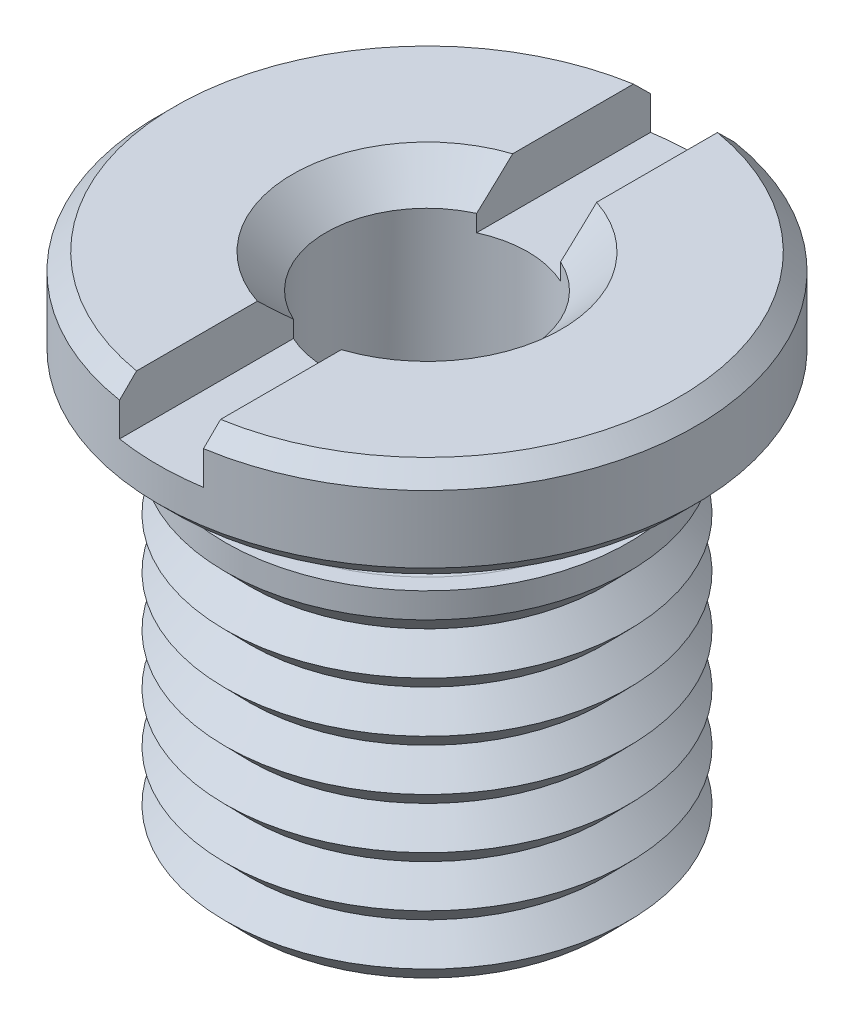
from build123d import *

# Parameters (mm, degrees)
SKETCH2_W           = 2.5
SKETCH2_H           = 16
EXTRUDE1_DEPTH      = 1.5
LPATTERN1_COUNT     = 7
LPATTERN1_PITCH     = 1.5
SKETCH3_R           = 4.5
SKETCH3_R_2         = 3.5
EXTRUDE_THIN1_DEPTH = 0.5
SKETCH4_R           = 4.25
EXTRUDE2_DEPTH      = 6


with BuildPart() as part:
    # Sketch1 → Revolve1 (revolve)
    with BuildSketch(Plane.XY, mode=Mode.PRIVATE) as revolve1_sk:
        with BuildLine():
            Line((4, 15), (7.5, 15))
            Line((7.5, 15), (8, 14.5))
            Line((8, 14.5), (8, 12.5))
            Line((8, 12.5), (7.5, 12))
            Line((7.5, 12), (5.5, 12))
            ThreePointArc((5.5, 12), (5.146446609, 11.853553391), (5, 11.5))
            Line((5, 11.5), (5, 11))
            ThreePointArc((5, 11), (5.146446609, 10.646446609), (5.5, 10.5))
            Line((5.5, 10.5), (6, 10.5))
            Line((6, 10.5), (6, 0))
            Line((6, 0), (4.25, 0))
            Line((4.25, 0), (4.25, 2.5))
            Line((4.25, 2.5), (4.5, 2.5))
            Line((4.5, 2.5), (4.5, 3))
            Line((4.5, 3), (4.25, 3))
            Line((4.25, 3), (4.25, 9))
            Line((4.25, 9), (3, 9))
            Line((3, 9), (3, 14))
            Line((3, 14), (4, 15))
        make_face()
    revolve(revolve1_sk.sketch.rotate(Axis((0, 0, 0), (0, 1, 0)), 90), axis=Axis((0, 0, 0), (0, 1, 0)))

    # Sketch2 → Extrude1 (cut)
    with BuildSketch(Plane(origin=(0, 15, 0), x_dir=(1, 0, 0), z_dir=(0, 1, 0))):
        Rectangle(SKETCH2_W, SKETCH2_H)
    extrude(amount=-EXTRUDE1_DEPTH, mode=Mode.SUBTRACT)

    # Sketch5 → Cut-Revolve1 (revolve, cut)
    with BuildSketch(Plane.XY, mode=Mode.PRIVATE) as cut_revolve1_sk:
        Polygon((6, 0.75), (6, -0.75), (5.265153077, 0), align=None)
    cut_revolve1 = revolve(cut_revolve1_sk.sketch.rotate(Axis((0, 0, 0), (0, 1, 0)), 90), axis=Axis((0, 0, 0), (0, 1, 0)), mode=Mode.SUBTRACT)

    # LPattern1: Cut-Revolve1 ×7
    with Locations(*[(0, i * LPATTERN1_PITCH, 0) for i in range(1, LPATTERN1_COUNT)]):
        add(cut_revolve1, mode=Mode.SUBTRACT)


with BuildPart() as body_2:
    # Sketch3 → Extrude-Thin1 (new body)
    with BuildSketch(Plane.XZ.offset(-3)):
        Circle(SKETCH3_R)
        Circle(SKETCH3_R_2, mode=Mode.SUBTRACT)
    extrude(amount=EXTRUDE_THIN1_DEPTH)


with BuildPart() as body_3:
    # Sketch4 → Extrude2 (new body)
    with BuildSketch(Plane.XZ.offset(-9)):
        with Locations(Location((0, 0, 0), (0, 0, 270))):
            Circle(SKETCH4_R)
    extrude(amount=EXTRUDE2_DEPTH)


solid = Compound([part.part, body_2.part, body_3.part])
